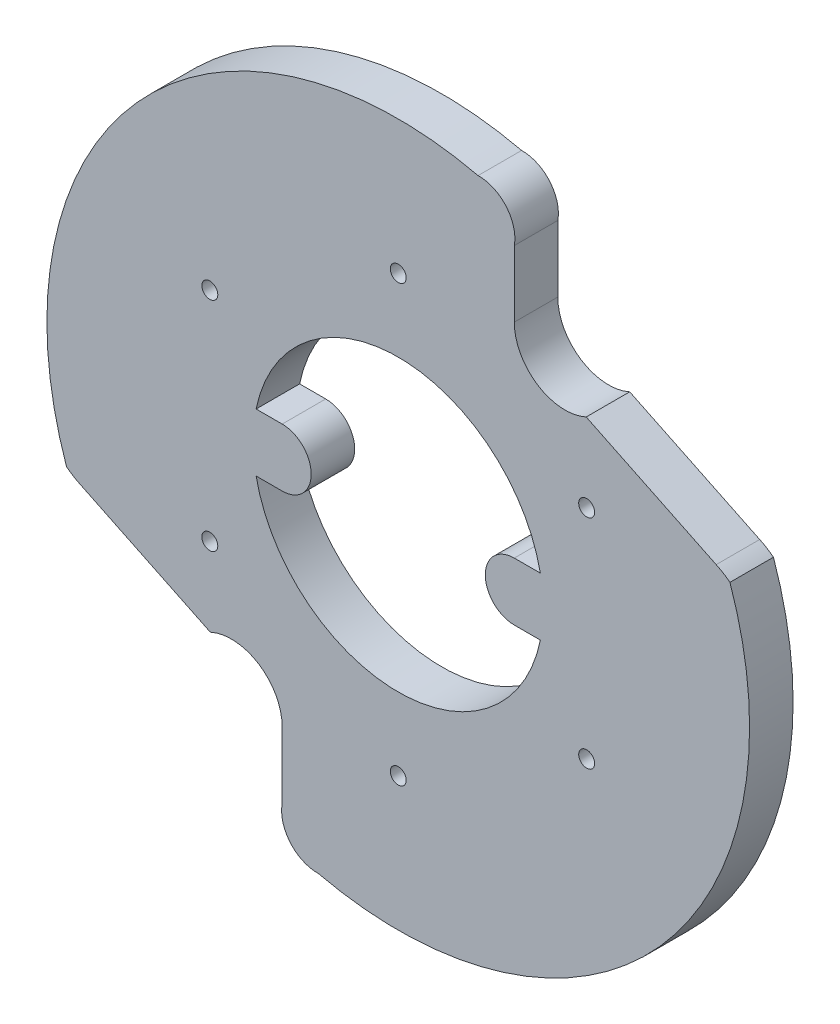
from build123d import *

# Parameters (mm, degrees)
ESQUISSE1_R        = 1.1
BOSS_EXTRU_1_DEPTH = 6


with BuildPart() as part:
    # Esquisse1 → Boss.-Extru.1 (new body)
    with BuildSketch(Plane.XY):
        with BuildLine():
            Line((25.912767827, 25.803614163), (43.838326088, 17.136311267))
            ThreePointArc((43.838326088, 17.136311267), (44.818744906, 16.606470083), (45.734120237, 15.97082809))
            ThreePointArc((45.734120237, 15.97082809), (47.760615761, 8.099425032), (48.442513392, 0))
            ThreePointArc((48.442513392, 0), (30.111552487, -37.946956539), (-11.008221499, -47.175164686))
            ThreePointArc((-11.008221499, -47.175164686), (-14.889950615, -45.421791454), (-16, -41.30962305))
            Line((-16, -41.30962305), (-16, -32.168815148))
            ThreePointArc((-16, -32.168815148), (-19.217763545, -26.278595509), (-25.912767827, -25.803614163))
            Line((-25.912767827, -25.803614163), (-43.838326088, -17.136311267))
            ThreePointArc((-43.838326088, -17.136311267), (-44.818744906, -16.606470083), (-45.734120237, -15.97082809))
            ThreePointArc((-45.734120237, -15.97082809), (-47.760615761, -8.099425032), (-48.442513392, 0))
            ThreePointArc((-48.442513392, 0), (-30.111552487, 37.946956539), (11.008221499, 47.175164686))
            ThreePointArc((11.008221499, 47.175164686), (14.889950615, 45.421791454), (16, 41.30962305))
            Line((16, 41.30962305), (16, 32.168815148))
            ThreePointArc((16, 32.168815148), (19.217763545, 26.278595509), (25.912767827, 25.803614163))
        make_face()
        with Locations((0, 30)):
            Circle(ESQUISSE1_R, mode=Mode.SUBTRACT)
        with Locations((25.980762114, 15)):
            Circle(ESQUISSE1_R, mode=Mode.SUBTRACT)
        with Locations((25.980762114, -15)):
            Circle(ESQUISSE1_R, mode=Mode.SUBTRACT)
        with Locations((0, -30)):
            Circle(ESQUISSE1_R, mode=Mode.SUBTRACT)
        with Locations((-25.980762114, -15)):
            Circle(ESQUISSE1_R, mode=Mode.SUBTRACT)
        with Locations((-25.980762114, 15)):
            Circle(ESQUISSE1_R, mode=Mode.SUBTRACT)
        with BuildLine():
            Line((-16, 4), (-19.595917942, 4))
            ThreePointArc((-19.595917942, 4), (0, 20), (19.595917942, 4))
            Line((19.595917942, 4), (16, 4))
            ThreePointArc((16, 4), (12, 0), (16, -4))
            Line((16, -4), (19.595917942, -4))
            ThreePointArc((19.595917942, -4), (0, -20), (-19.595917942, -4))
            Line((-19.595917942, -4), (-16, -4))
            ThreePointArc((-16, -4), (-12, 0), (-16, 4))
        make_face(mode=Mode.SUBTRACT)
    extrude(amount=BOSS_EXTRU_1_DEPTH)


solid = part.part
